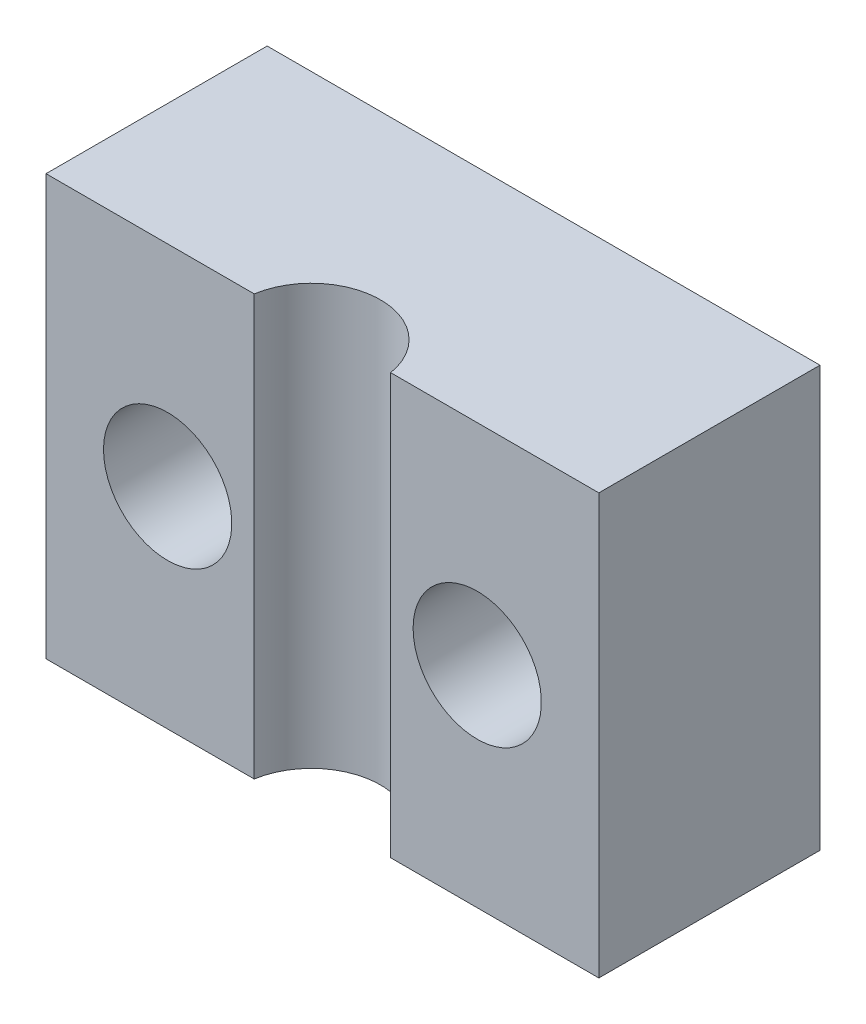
from build123d import *

# Parameters (mm, degrees)
EXTRUDE1_DEPTH     = 9.652
SKETCH2_R          = 1.4732
CUT_EXTRUDE1_DEPTH = 17.740893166


with BuildPart() as part:
    # Sketch1 → Extrude1 (new body)
    with BuildSketch(Plane(origin=(0, 0, 0), x_dir=(1, 0, 0), z_dir=(0, 1, 0))):
        with BuildLine():
            Line((0, 0), (4.78295174, 0))
            ThreePointArc((4.78295174, 0), (6.35, 1.3335), (7.91704826, 0))
            Line((7.91704826, 0), (12.7, 0))
            Line((12.7, 0), (12.7, 5.08))
            Line((12.7, 5.08), (0, 5.08))
            Line((0, 5.08), (0, 0))
        make_face()
    extrude(amount=EXTRUDE1_DEPTH)

    # Sketch2 → Cut-Extrude1 (cut, through all)
    with BuildSketch(Plane(origin=(0, 0, -5.08), x_dir=(-1, 0, 0), z_dir=(0, 0, -1))):
        with Locations((-9.906, 4.826)):
            Circle(SKETCH2_R)
        with Locations((-2.794, 4.826)):
            Circle(SKETCH2_R)
    extrude(amount=-CUT_EXTRUDE1_DEPTH, mode=Mode.SUBTRACT)


solid = part.part
